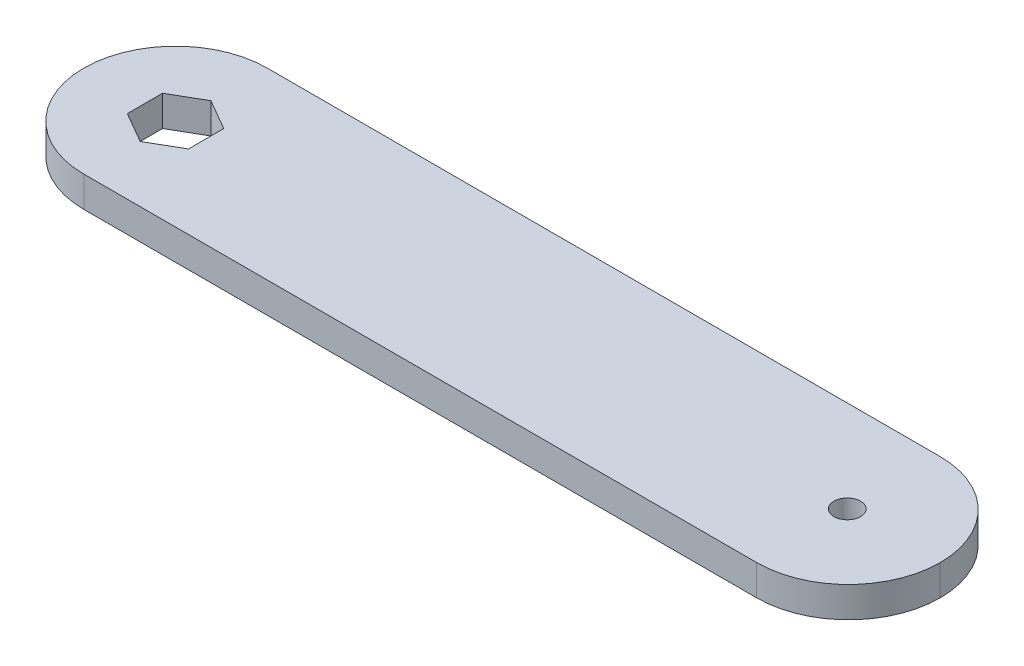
ISO-10303-21;
HEADER;
FILE_DESCRIPTION(('STEP AP214'),'2;1');
FILE_NAME('part.step','',(''),(''),'','','');
FILE_SCHEMA(('AUTOMOTIVE_DESIGN { 1 0 10303 214 1 1 1 1 }'));
ENDSEC;
DATA;
#1=APPLICATION_CONTEXT('core data for automotive mechanical design processes');
#2=APPLICATION_PROTOCOL_DEFINITION('international standard','automotive_design',2000,#1);
#3=PRODUCT_CONTEXT('',#1,'mechanical');
#4=PRODUCT('Part','Part','',(#3));
#5=PRODUCT_RELATED_PRODUCT_CATEGORY('part','',(#4));
#6=PRODUCT_DEFINITION_FORMATION('','',#4);
#7=PRODUCT_DEFINITION_CONTEXT('part definition',#1,'design');
#8=PRODUCT_DEFINITION('design','',#6,#7);
#9=PRODUCT_DEFINITION_SHAPE('','',#8);
#10=(LENGTH_UNIT() NAMED_UNIT(*) SI_UNIT(.MILLI.,.METRE.));
#11=(NAMED_UNIT(*) PLANE_ANGLE_UNIT() SI_UNIT($,.RADIAN.));
#12=(NAMED_UNIT(*) SI_UNIT($,.STERADIAN.) SOLID_ANGLE_UNIT());
#13=UNCERTAINTY_MEASURE_WITH_UNIT(LENGTH_MEASURE(1.E-05),#10,'distance_accuracy_value','');
#14=(GEOMETRIC_REPRESENTATION_CONTEXT(3) GLOBAL_UNCERTAINTY_ASSIGNED_CONTEXT((#13)) GLOBAL_UNIT_ASSIGNED_CONTEXT((#10,
#11,#12)) REPRESENTATION_CONTEXT('',''));
#15=CARTESIAN_POINT('',(0.,0.,0.));
#16=DIRECTION('',(0.,0.,1.));
#17=DIRECTION('',(1.,0.,0.));
#18=AXIS2_PLACEMENT_3D('',#15,#16,#17);
#19=CARTESIAN_POINT('',(0.,3.175,0.));
#20=DIRECTION('',(0.,-1.,0.));
#21=DIRECTION('',(0.,0.,-1.));
#22=AXIS2_PLACEMENT_3D('',#19,#20,#21);
#23=PLANE('',#22);
#24=CARTESIAN_POINT('',(79.375,3.175,-9.525));
#25=DIRECTION('',(0.,-1.,0.));
#26=DIRECTION('',(0.,0.,-1.));
#27=AXIS2_PLACEMENT_3D('',#24,#25,#26);
#28=CIRCLE('',#27,9.525);
#29=CARTESIAN_POINT('',(79.375,3.175,0.));
#30=VERTEX_POINT('',#29);
#31=CARTESIAN_POINT('',(88.9,3.175,-9.525));
#32=VERTEX_POINT('',#31);
#33=EDGE_CURVE('E50',#30,#32,#28,.F.);
#34=ORIENTED_EDGE('',*,*,#33,.T.);
#35=CARTESIAN_POINT('',(79.375,3.175,-9.525));
#36=DIRECTION('',(0.,-1.,0.));
#37=DIRECTION('',(0.,0.,-1.));
#38=AXIS2_PLACEMENT_3D('',#35,#36,#37);
#39=CIRCLE('',#38,9.525);
#40=CARTESIAN_POINT('',(79.375,3.175,-19.05));
#41=VERTEX_POINT('',#40);
#42=EDGE_CURVE('E211',#32,#41,#39,.F.);
#43=ORIENTED_EDGE('',*,*,#42,.T.);
#44=DIRECTION('',(-1.,0.,0.));
#45=VECTOR('',#44,1.);
#46=CARTESIAN_POINT('',(0.,3.175,-19.05));
#47=LINE('',#46,#45);
#48=CARTESIAN_POINT('',(9.525,3.175,-19.05));
#49=VERTEX_POINT('',#48);
#50=EDGE_CURVE('E186',#41,#49,#47,.T.);
#51=ORIENTED_EDGE('',*,*,#50,.T.);
#52=CARTESIAN_POINT('',(9.525,3.175,-9.525));
#53=DIRECTION('',(0.,-1.,0.));
#54=DIRECTION('',(0.,0.,-1.));
#55=AXIS2_PLACEMENT_3D('',#52,#53,#54);
#56=CIRCLE('',#55,9.525);
#57=CARTESIAN_POINT('',(0.,3.175,-9.525));
#58=VERTEX_POINT('',#57);
#59=EDGE_CURVE('E206',#49,#58,#56,.F.);
#60=ORIENTED_EDGE('',*,*,#59,.T.);
#61=CARTESIAN_POINT('',(9.525,3.175,-9.525));
#62=DIRECTION('',(0.,-1.,0.));
#63=DIRECTION('',(0.,0.,-1.));
#64=AXIS2_PLACEMENT_3D('',#61,#62,#63);
#65=CIRCLE('',#64,9.525);
#66=CARTESIAN_POINT('',(9.525,3.175,0.));
#67=VERTEX_POINT('',#66);
#68=EDGE_CURVE('E208',#58,#67,#65,.F.);
#69=ORIENTED_EDGE('',*,*,#68,.T.);
#70=DIRECTION('',(1.,0.,0.));
#71=VECTOR('',#70,1.);
#72=CARTESIAN_POINT('',(0.,3.175,0.));
#73=LINE('',#72,#71);
#74=EDGE_CURVE('E184',#67,#30,#73,.T.);
#75=ORIENTED_EDGE('',*,*,#74,.T.);
#76=EDGE_LOOP('',(#34,#43,#51,#60,#69,#75));
#77=FACE_BOUND('',#76,.T.);
#78=DIRECTION('',(-0.866025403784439,0.,-0.5));
#79=VECTOR('',#78,1.);
#80=CARTESIAN_POINT('',(12.7,3.175,-11.3580871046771));
#81=LINE('',#80,#79);
#82=CARTESIAN_POINT('',(12.7,3.175,-11.3580871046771));
#83=VERTEX_POINT('',#82);
#84=CARTESIAN_POINT('',(9.525,3.175,-13.1911742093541));
#85=VERTEX_POINT('',#84);
#86=EDGE_CURVE('E125',#83,#85,#81,.T.);
#87=ORIENTED_EDGE('',*,*,#86,.F.);
#88=DIRECTION('',(0.,0.,-1.));
#89=VECTOR('',#88,1.);
#90=CARTESIAN_POINT('',(12.7,3.175,-7.69191289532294));
#91=LINE('',#90,#89);
#92=CARTESIAN_POINT('',(12.7,3.175,-7.69191289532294));
#93=VERTEX_POINT('',#92);
#94=EDGE_CURVE('E159',#93,#83,#91,.T.);
#95=ORIENTED_EDGE('',*,*,#94,.F.);
#96=DIRECTION('',(0.866025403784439,0.,-0.5));
#97=VECTOR('',#96,1.);
#98=CARTESIAN_POINT('',(9.525,3.175,-5.85882579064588));
#99=LINE('',#98,#97);
#100=CARTESIAN_POINT('',(9.525,3.175,-5.85882579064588));
#101=VERTEX_POINT('',#100);
#102=EDGE_CURVE('E156',#101,#93,#99,.T.);
#103=ORIENTED_EDGE('',*,*,#102,.F.);
#104=DIRECTION('',(0.866025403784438,0.,0.5));
#105=VECTOR('',#104,1.);
#106=CARTESIAN_POINT('',(6.35,3.175,-7.69191289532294));
#107=LINE('',#106,#105);
#108=CARTESIAN_POINT('',(6.35,3.175,-7.69191289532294));
#109=VERTEX_POINT('',#108);
#110=EDGE_CURVE('E151',#109,#101,#107,.T.);
#111=ORIENTED_EDGE('',*,*,#110,.F.);
#112=DIRECTION('',(0.,0.,1.));
#113=VECTOR('',#112,1.);
#114=CARTESIAN_POINT('',(6.35000000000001,3.175,-11.3580871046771));
#115=LINE('',#114,#113);
#116=CARTESIAN_POINT('',(6.35000000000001,3.175,-11.3580871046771));
#117=VERTEX_POINT('',#116);
#118=EDGE_CURVE('E149',#117,#109,#115,.T.);
#119=ORIENTED_EDGE('',*,*,#118,.F.);
#120=DIRECTION('',(-0.866025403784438,0.,0.5));
#121=VECTOR('',#120,1.);
#122=CARTESIAN_POINT('',(9.525,3.175,-13.1911742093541));
#123=LINE('',#122,#121);
#124=EDGE_CURVE('E135',#85,#117,#123,.T.);
#125=ORIENTED_EDGE('',*,*,#124,.F.);
#126=EDGE_LOOP('',(#87,#95,#103,#111,#119,#125));
#127=FACE_BOUND('',#126,.T.);
#128=CARTESIAN_POINT('',(79.248,3.175,-9.525));
#129=DIRECTION('',(0.,1.,0.));
#130=DIRECTION('',(0.,0.,1.));
#131=AXIS2_PLACEMENT_3D('',#128,#129,#130);
#132=CIRCLE('',#131,1.38906249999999);
#133=CARTESIAN_POINT('',(79.248,3.175,-8.13593750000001));
#134=VERTEX_POINT('',#133);
#135=EDGE_CURVE('E163',#134,#134,#132,.T.);
#136=ORIENTED_EDGE('',*,*,#135,.F.);
#137=EDGE_LOOP('',(#136));
#138=FACE_BOUND('',#137,.T.);
#139=ADVANCED_FACE('F33',(#77,#127,#138),#23,.F.);
#140=CARTESIAN_POINT('',(0.,0.,0.));
#141=DIRECTION('',(0.,-1.,0.));
#142=DIRECTION('',(0.,0.,-1.));
#143=AXIS2_PLACEMENT_3D('',#140,#141,#142);
#144=PLANE('',#143);
#145=DIRECTION('',(0.,0.,-1.));
#146=VECTOR('',#145,1.);
#147=CARTESIAN_POINT('',(12.7,0.,-7.69191289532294));
#148=LINE('',#147,#146);
#149=CARTESIAN_POINT('',(12.7,0.,-7.69191289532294));
#150=VERTEX_POINT('',#149);
#151=CARTESIAN_POINT('',(12.7,0.,-11.3580871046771));
#152=VERTEX_POINT('',#151);
#153=EDGE_CURVE('E136',#150,#152,#148,.T.);
#154=ORIENTED_EDGE('',*,*,#153,.T.);
#155=DIRECTION('',(-0.866025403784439,0.,-0.5));
#156=VECTOR('',#155,1.);
#157=CARTESIAN_POINT('',(12.7,0.,-11.3580871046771));
#158=LINE('',#157,#156);
#159=CARTESIAN_POINT('',(9.525,0.,-13.1911742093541));
#160=VERTEX_POINT('',#159);
#161=EDGE_CURVE('E161',#152,#160,#158,.T.);
#162=ORIENTED_EDGE('',*,*,#161,.T.);
#163=DIRECTION('',(-0.866025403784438,0.,0.5));
#164=VECTOR('',#163,1.);
#165=CARTESIAN_POINT('',(9.525,0.,-13.1911742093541));
#166=LINE('',#165,#164);
#167=CARTESIAN_POINT('',(6.35000000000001,0.,-11.3580871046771));
#168=VERTEX_POINT('',#167);
#169=EDGE_CURVE('E142',#160,#168,#166,.T.);
#170=ORIENTED_EDGE('',*,*,#169,.T.);
#171=DIRECTION('',(0.,0.,1.));
#172=VECTOR('',#171,1.);
#173=CARTESIAN_POINT('',(6.35000000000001,0.,-11.3580871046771));
#174=LINE('',#173,#172);
#175=CARTESIAN_POINT('',(6.35,0.,-7.69191289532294));
#176=VERTEX_POINT('',#175);
#177=EDGE_CURVE('E165',#168,#176,#174,.T.);
#178=ORIENTED_EDGE('',*,*,#177,.T.);
#179=DIRECTION('',(0.866025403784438,0.,0.5));
#180=VECTOR('',#179,1.);
#181=CARTESIAN_POINT('',(6.35,0.,-7.69191289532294));
#182=LINE('',#181,#180);
#183=CARTESIAN_POINT('',(9.525,0.,-5.85882579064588));
#184=VERTEX_POINT('',#183);
#185=EDGE_CURVE('E168',#176,#184,#182,.T.);
#186=ORIENTED_EDGE('',*,*,#185,.T.);
#187=DIRECTION('',(0.866025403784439,0.,-0.5));
#188=VECTOR('',#187,1.);
#189=CARTESIAN_POINT('',(9.525,0.,-5.85882579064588));
#190=LINE('',#189,#188);
#191=EDGE_CURVE('E171',#184,#150,#190,.T.);
#192=ORIENTED_EDGE('',*,*,#191,.T.);
#193=EDGE_LOOP('',(#154,#162,#170,#178,#186,#192));
#194=FACE_BOUND('',#193,.T.);
#195=DIRECTION('',(-1.,0.,0.));
#196=VECTOR('',#195,1.);
#197=CARTESIAN_POINT('',(0.,0.,-19.05));
#198=LINE('',#197,#196);
#199=CARTESIAN_POINT('',(79.375,0.,-19.05));
#200=VERTEX_POINT('',#199);
#201=CARTESIAN_POINT('',(9.525,0.,-19.05));
#202=VERTEX_POINT('',#201);
#203=EDGE_CURVE('E187',#200,#202,#198,.T.);
#204=ORIENTED_EDGE('',*,*,#203,.F.);
#205=CARTESIAN_POINT('',(79.375,0.,-9.525));
#206=DIRECTION('',(0.,-1.,0.));
#207=DIRECTION('',(0.,0.,-1.));
#208=AXIS2_PLACEMENT_3D('',#205,#206,#207);
#209=CIRCLE('',#208,9.525);
#210=CARTESIAN_POINT('',(88.9,0.,-9.525));
#211=VERTEX_POINT('',#210);
#212=EDGE_CURVE('E204',#200,#211,#209,.T.);
#213=ORIENTED_EDGE('',*,*,#212,.T.);
#214=CARTESIAN_POINT('',(79.375,0.,-9.525));
#215=DIRECTION('',(0.,-1.,0.));
#216=DIRECTION('',(0.,0.,-1.));
#217=AXIS2_PLACEMENT_3D('',#214,#215,#216);
#218=CIRCLE('',#217,9.525);
#219=CARTESIAN_POINT('',(79.375,0.,0.));
#220=VERTEX_POINT('',#219);
#221=EDGE_CURVE('E202',#211,#220,#218,.T.);
#222=ORIENTED_EDGE('',*,*,#221,.T.);
#223=DIRECTION('',(1.,0.,0.));
#224=VECTOR('',#223,1.);
#225=CARTESIAN_POINT('',(0.,0.,0.));
#226=LINE('',#225,#224);
#227=CARTESIAN_POINT('',(9.525,0.,0.));
#228=VERTEX_POINT('',#227);
#229=EDGE_CURVE('E143',#228,#220,#226,.T.);
#230=ORIENTED_EDGE('',*,*,#229,.F.);
#231=CARTESIAN_POINT('',(9.525,0.,-9.525));
#232=DIRECTION('',(0.,-1.,0.));
#233=DIRECTION('',(0.,0.,-1.));
#234=AXIS2_PLACEMENT_3D('',#231,#232,#233);
#235=CIRCLE('',#234,9.525);
#236=CARTESIAN_POINT('',(0.,0.,-9.525));
#237=VERTEX_POINT('',#236);
#238=EDGE_CURVE('E200',#228,#237,#235,.T.);
#239=ORIENTED_EDGE('',*,*,#238,.T.);
#240=CARTESIAN_POINT('',(9.525,0.,-9.525));
#241=DIRECTION('',(0.,-1.,0.));
#242=DIRECTION('',(0.,0.,-1.));
#243=AXIS2_PLACEMENT_3D('',#240,#241,#242);
#244=CIRCLE('',#243,9.525);
#245=EDGE_CURVE('E198',#237,#202,#244,.T.);
#246=ORIENTED_EDGE('',*,*,#245,.T.);
#247=EDGE_LOOP('',(#204,#213,#222,#230,#239,#246));
#248=FACE_BOUND('',#247,.T.);
#249=CARTESIAN_POINT('',(79.248,0.,-9.525));
#250=DIRECTION('',(0.,1.,0.));
#251=DIRECTION('',(0.,0.,1.));
#252=AXIS2_PLACEMENT_3D('',#249,#250,#251);
#253=CIRCLE('',#252,1.38906249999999);
#254=CARTESIAN_POINT('',(79.248,0.,-8.13593750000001));
#255=VERTEX_POINT('',#254);
#256=EDGE_CURVE('E216',#255,#255,#253,.T.);
#257=ORIENTED_EDGE('',*,*,#256,.T.);
#258=EDGE_LOOP('',(#257));
#259=FACE_BOUND('',#258,.T.);
#260=ADVANCED_FACE('F232',(#194,#248,#259),#144,.T.);
#261=CARTESIAN_POINT('',(0.,3.175,0.));
#262=DIRECTION('',(0.,0.,-1.));
#263=DIRECTION('',(-1.,0.,0.));
#264=AXIS2_PLACEMENT_3D('',#261,#262,#263);
#265=PLANE('',#264);
#266=ORIENTED_EDGE('',*,*,#229,.T.);
#267=DIRECTION('',(0.,-1.,0.));
#268=VECTOR('',#267,1.);
#269=CARTESIAN_POINT('',(79.375,3.175,0.));
#270=LINE('',#269,#268);
#271=EDGE_CURVE('E11',#220,#30,#270,.F.);
#272=ORIENTED_EDGE('',*,*,#271,.T.);
#273=ORIENTED_EDGE('',*,*,#74,.F.);
#274=DIRECTION('',(0.,-1.,0.));
#275=VECTOR('',#274,1.);
#276=CARTESIAN_POINT('',(9.525,3.175,0.));
#277=LINE('',#276,#275);
#278=EDGE_CURVE('E42',#67,#228,#277,.T.);
#279=ORIENTED_EDGE('',*,*,#278,.T.);
#280=EDGE_LOOP('',(#266,#272,#273,#279));
#281=FACE_BOUND('',#280,.T.);
#282=ADVANCED_FACE('F259',(#281),#265,.F.);
#283=CARTESIAN_POINT('',(0.,3.175,-19.05));
#284=DIRECTION('',(0.,0.,1.));
#285=DIRECTION('',(1.,0.,0.));
#286=AXIS2_PLACEMENT_3D('',#283,#284,#285);
#287=PLANE('',#286);
#288=ORIENTED_EDGE('',*,*,#50,.F.);
#289=DIRECTION('',(0.,-1.,0.));
#290=VECTOR('',#289,1.);
#291=CARTESIAN_POINT('',(79.375,3.175,-19.05));
#292=LINE('',#291,#290);
#293=EDGE_CURVE('E195',#41,#200,#292,.T.);
#294=ORIENTED_EDGE('',*,*,#293,.T.);
#295=ORIENTED_EDGE('',*,*,#203,.T.);
#296=DIRECTION('',(0.,-1.,0.));
#297=VECTOR('',#296,1.);
#298=CARTESIAN_POINT('',(9.525,3.175,-19.05));
#299=LINE('',#298,#297);
#300=EDGE_CURVE('E190',#202,#49,#299,.F.);
#301=ORIENTED_EDGE('',*,*,#300,.T.);
#302=EDGE_LOOP('',(#288,#294,#295,#301));
#303=FACE_BOUND('',#302,.T.);
#304=ADVANCED_FACE('F237',(#303),#287,.F.);
#305=CARTESIAN_POINT('',(12.7,3.175,-11.3580871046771));
#306=DIRECTION('',(-0.5,0.,0.866025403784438));
#307=DIRECTION('',(0.866025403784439,0.,0.5));
#308=AXIS2_PLACEMENT_3D('',#305,#306,#307);
#309=PLANE('',#308);
#310=ORIENTED_EDGE('',*,*,#161,.F.);
#311=DIRECTION('',(0.,-1.,0.));
#312=VECTOR('',#311,1.);
#313=CARTESIAN_POINT('',(12.7,3.175,-11.3580871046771));
#314=LINE('',#313,#312);
#315=EDGE_CURVE('E131',#83,#152,#314,.T.);
#316=ORIENTED_EDGE('',*,*,#315,.F.);
#317=ORIENTED_EDGE('',*,*,#86,.T.);
#318=DIRECTION('',(0.,-1.,0.));
#319=VECTOR('',#318,1.);
#320=CARTESIAN_POINT('',(9.525,3.175,-13.1911742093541));
#321=LINE('',#320,#319);
#322=EDGE_CURVE('E128',#85,#160,#321,.T.);
#323=ORIENTED_EDGE('',*,*,#322,.T.);
#324=EDGE_LOOP('',(#310,#316,#317,#323));
#325=FACE_BOUND('',#324,.T.);
#326=ADVANCED_FACE('F127',(#325),#309,.T.);
#327=CARTESIAN_POINT('',(9.525,3.175,-13.1911742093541));
#328=DIRECTION('',(0.5,0.,0.866025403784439));
#329=DIRECTION('',(0.866025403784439,0.,-0.5));
#330=AXIS2_PLACEMENT_3D('',#327,#328,#329);
#331=PLANE('',#330);
#332=ORIENTED_EDGE('',*,*,#169,.F.);
#333=ORIENTED_EDGE('',*,*,#322,.F.);
#334=ORIENTED_EDGE('',*,*,#124,.T.);
#335=DIRECTION('',(0.,-1.,0.));
#336=VECTOR('',#335,1.);
#337=CARTESIAN_POINT('',(6.35000000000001,3.175,-11.3580871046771));
#338=LINE('',#337,#336);
#339=EDGE_CURVE('E144',#117,#168,#338,.T.);
#340=ORIENTED_EDGE('',*,*,#339,.T.);
#341=EDGE_LOOP('',(#332,#333,#334,#340));
#342=FACE_BOUND('',#341,.T.);
#343=ADVANCED_FACE('F139',(#342),#331,.T.);
#344=CARTESIAN_POINT('',(6.35000000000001,3.175,-11.3580871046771));
#345=DIRECTION('',(1.,0.,0.));
#346=DIRECTION('',(0.,0.,-1.));
#347=AXIS2_PLACEMENT_3D('',#344,#345,#346);
#348=PLANE('',#347);
#349=ORIENTED_EDGE('',*,*,#177,.F.);
#350=ORIENTED_EDGE('',*,*,#339,.F.);
#351=ORIENTED_EDGE('',*,*,#118,.T.);
#352=DIRECTION('',(0.,-1.,0.));
#353=VECTOR('',#352,1.);
#354=CARTESIAN_POINT('',(6.35,3.175,-7.69191289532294));
#355=LINE('',#354,#353);
#356=EDGE_CURVE('E181',#109,#176,#355,.T.);
#357=ORIENTED_EDGE('',*,*,#356,.T.);
#358=EDGE_LOOP('',(#349,#350,#351,#357));
#359=FACE_BOUND('',#358,.T.);
#360=ADVANCED_FACE('F287',(#359),#348,.T.);
#361=CARTESIAN_POINT('',(6.35,3.175,-7.69191289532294));
#362=DIRECTION('',(0.5,0.,-0.866025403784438));
#363=DIRECTION('',(-0.866025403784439,0.,-0.5));
#364=AXIS2_PLACEMENT_3D('',#361,#362,#363);
#365=PLANE('',#364);
#366=ORIENTED_EDGE('',*,*,#185,.F.);
#367=ORIENTED_EDGE('',*,*,#356,.F.);
#368=ORIENTED_EDGE('',*,*,#110,.T.);
#369=DIRECTION('',(0.,-1.,0.));
#370=VECTOR('',#369,1.);
#371=CARTESIAN_POINT('',(9.525,3.175,-5.85882579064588));
#372=LINE('',#371,#370);
#373=EDGE_CURVE('E179',#101,#184,#372,.T.);
#374=ORIENTED_EDGE('',*,*,#373,.T.);
#375=EDGE_LOOP('',(#366,#367,#368,#374));
#376=FACE_BOUND('',#375,.T.);
#377=ADVANCED_FACE('F293',(#376),#365,.T.);
#378=CARTESIAN_POINT('',(9.525,3.175,-5.85882579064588));
#379=DIRECTION('',(-0.5,0.,-0.866025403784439));
#380=DIRECTION('',(-0.866025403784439,0.,0.5));
#381=AXIS2_PLACEMENT_3D('',#378,#379,#380);
#382=PLANE('',#381);
#383=ORIENTED_EDGE('',*,*,#191,.F.);
#384=ORIENTED_EDGE('',*,*,#373,.F.);
#385=ORIENTED_EDGE('',*,*,#102,.T.);
#386=DIRECTION('',(0.,-1.,0.));
#387=VECTOR('',#386,1.);
#388=CARTESIAN_POINT('',(12.7,3.175,-7.69191289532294));
#389=LINE('',#388,#387);
#390=EDGE_CURVE('E177',#93,#150,#389,.T.);
#391=ORIENTED_EDGE('',*,*,#390,.T.);
#392=EDGE_LOOP('',(#383,#384,#385,#391));
#393=FACE_BOUND('',#392,.T.);
#394=ADVANCED_FACE('F301',(#393),#382,.T.);
#395=CARTESIAN_POINT('',(12.7,3.175,-7.69191289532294));
#396=DIRECTION('',(-1.,0.,0.));
#397=DIRECTION('',(0.,0.,1.));
#398=AXIS2_PLACEMENT_3D('',#395,#396,#397);
#399=PLANE('',#398);
#400=ORIENTED_EDGE('',*,*,#153,.F.);
#401=ORIENTED_EDGE('',*,*,#390,.F.);
#402=ORIENTED_EDGE('',*,*,#94,.T.);
#403=ORIENTED_EDGE('',*,*,#315,.T.);
#404=EDGE_LOOP('',(#400,#401,#402,#403));
#405=FACE_BOUND('',#404,.T.);
#406=ADVANCED_FACE('F251',(#405),#399,.T.);
#407=CARTESIAN_POINT('',(79.248,3.175,-9.525));
#408=DIRECTION('',(0.,-1.,0.));
#409=DIRECTION('',(0.,0.,-1.));
#410=AXIS2_PLACEMENT_3D('',#407,#408,#409);
#411=CYLINDRICAL_SURFACE('',#410,1.38906249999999);
#412=ORIENTED_EDGE('',*,*,#135,.T.);
#413=EDGE_LOOP('',(#412));
#414=FACE_BOUND('',#413,.T.);
#415=ORIENTED_EDGE('',*,*,#256,.F.);
#416=EDGE_LOOP('',(#415));
#417=FACE_BOUND('',#416,.T.);
#418=ADVANCED_FACE('F244',(#414,#417),#411,.F.);
#419=CARTESIAN_POINT('',(79.375,3.175,-9.525));
#420=DIRECTION('',(0.,-1.,0.));
#421=DIRECTION('',(0.,0.,-1.));
#422=AXIS2_PLACEMENT_3D('',#419,#420,#421);
#423=CYLINDRICAL_SURFACE('',#422,9.525);
#424=DIRECTION('',(0.,-1.,0.));
#425=VECTOR('',#424,1.);
#426=CARTESIAN_POINT('',(88.9,3.175,-9.525));
#427=LINE('',#426,#425);
#428=EDGE_CURVE('E214',#32,#211,#427,.T.);
#429=ORIENTED_EDGE('',*,*,#428,.F.);
#430=ORIENTED_EDGE('',*,*,#33,.F.);
#431=ORIENTED_EDGE('',*,*,#271,.F.);
#432=ORIENTED_EDGE('',*,*,#221,.F.);
#433=EDGE_LOOP('',(#429,#430,#431,#432));
#434=FACE_BOUND('',#433,.T.);
#435=ADVANCED_FACE('F242',(#434),#423,.T.);
#436=CARTESIAN_POINT('',(79.375,3.175,-9.525));
#437=DIRECTION('',(0.,-1.,0.));
#438=DIRECTION('',(0.,0.,-1.));
#439=AXIS2_PLACEMENT_3D('',#436,#437,#438);
#440=CYLINDRICAL_SURFACE('',#439,9.525);
#441=ORIENTED_EDGE('',*,*,#42,.F.);
#442=ORIENTED_EDGE('',*,*,#428,.T.);
#443=ORIENTED_EDGE('',*,*,#212,.F.);
#444=ORIENTED_EDGE('',*,*,#293,.F.);
#445=EDGE_LOOP('',(#441,#442,#443,#444));
#446=FACE_BOUND('',#445,.T.);
#447=ADVANCED_FACE('F239',(#446),#440,.T.);
#448=CARTESIAN_POINT('',(9.525,3.175,-9.525));
#449=DIRECTION('',(0.,-1.,0.));
#450=DIRECTION('',(0.,0.,-1.));
#451=AXIS2_PLACEMENT_3D('',#448,#449,#450);
#452=CYLINDRICAL_SURFACE('',#451,9.525);
#453=DIRECTION('',(0.,-1.,0.));
#454=VECTOR('',#453,1.);
#455=CARTESIAN_POINT('',(0.,3.175,-9.525));
#456=LINE('',#455,#454);
#457=EDGE_CURVE('E37',#58,#237,#456,.T.);
#458=ORIENTED_EDGE('',*,*,#457,.F.);
#459=ORIENTED_EDGE('',*,*,#59,.F.);
#460=ORIENTED_EDGE('',*,*,#300,.F.);
#461=ORIENTED_EDGE('',*,*,#245,.F.);
#462=EDGE_LOOP('',(#458,#459,#460,#461));
#463=FACE_BOUND('',#462,.T.);
#464=ADVANCED_FACE('F35',(#463),#452,.T.);
#465=CARTESIAN_POINT('',(9.525,3.175,-9.525));
#466=DIRECTION('',(0.,-1.,0.));
#467=DIRECTION('',(0.,0.,-1.));
#468=AXIS2_PLACEMENT_3D('',#465,#466,#467);
#469=CYLINDRICAL_SURFACE('',#468,9.525);
#470=ORIENTED_EDGE('',*,*,#68,.F.);
#471=ORIENTED_EDGE('',*,*,#457,.T.);
#472=ORIENTED_EDGE('',*,*,#238,.F.);
#473=ORIENTED_EDGE('',*,*,#278,.F.);
#474=EDGE_LOOP('',(#470,#471,#472,#473));
#475=FACE_BOUND('',#474,.T.);
#476=ADVANCED_FACE('F224',(#475),#469,.T.);
#477=CLOSED_SHELL('',(#139,#260,#282,#304,#326,#343,#360,#377,#394,#406,#418,#435,#447,#464,#476));
#478=MANIFOLD_SOLID_BREP('B2',#477);
#479=ADVANCED_BREP_SHAPE_REPRESENTATION('',(#18,#478),#14);
#480=SHAPE_DEFINITION_REPRESENTATION(#9,#479);
ENDSEC;
END-ISO-10303-21;
